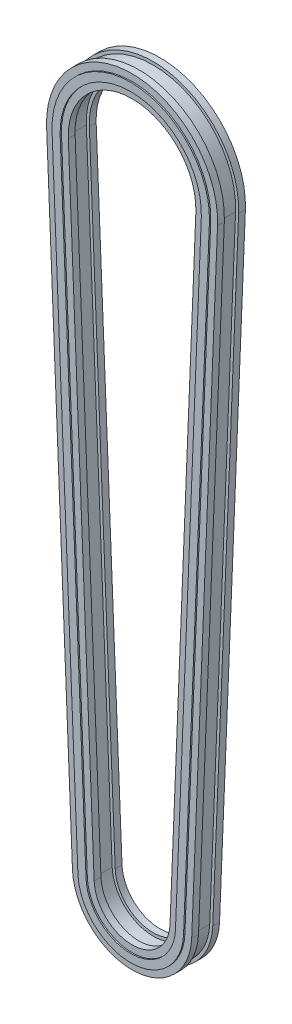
ISO-10303-21;
HEADER;
FILE_DESCRIPTION(('STEP AP214'),'2;1');
FILE_NAME('part.step','',(''),(''),'','','');
FILE_SCHEMA(('AUTOMOTIVE_DESIGN { 1 0 10303 214 1 1 1 1 }'));
ENDSEC;
DATA;
#1=APPLICATION_CONTEXT('core data for automotive mechanical design processes');
#2=APPLICATION_PROTOCOL_DEFINITION('international standard','automotive_design',2000,#1);
#3=PRODUCT_CONTEXT('',#1,'mechanical');
#4=PRODUCT('Part','Part','',(#3));
#5=PRODUCT_RELATED_PRODUCT_CATEGORY('part','',(#4));
#6=PRODUCT_DEFINITION_FORMATION('','',#4);
#7=PRODUCT_DEFINITION_CONTEXT('part definition',#1,'design');
#8=PRODUCT_DEFINITION('design','',#6,#7);
#9=PRODUCT_DEFINITION_SHAPE('','',#8);
#10=(LENGTH_UNIT() NAMED_UNIT(*) SI_UNIT(.MILLI.,.METRE.));
#11=(NAMED_UNIT(*) PLANE_ANGLE_UNIT() SI_UNIT($,.RADIAN.));
#12=(NAMED_UNIT(*) SI_UNIT($,.STERADIAN.) SOLID_ANGLE_UNIT());
#13=UNCERTAINTY_MEASURE_WITH_UNIT(LENGTH_MEASURE(1.E-05),#10,'distance_accuracy_value','');
#14=(GEOMETRIC_REPRESENTATION_CONTEXT(3) GLOBAL_UNCERTAINTY_ASSIGNED_CONTEXT((#13)) GLOBAL_UNIT_ASSIGNED_CONTEXT((#10,
#11,#12)) REPRESENTATION_CONTEXT('',''));
#15=CARTESIAN_POINT('',(0.,0.,0.));
#16=DIRECTION('',(0.,0.,1.));
#17=DIRECTION('',(1.,0.,0.));
#18=AXIS2_PLACEMENT_3D('',#15,#16,#17);
#19=CARTESIAN_POINT('',(20.6126482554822,-0.84595029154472,7.57));
#20=DIRECTION('',(-0.999158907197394,0.0410058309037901,0.));
#21=DIRECTION('',(-0.0410058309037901,-0.999158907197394,0.));
#22=AXIS2_PLACEMENT_3D('',#19,#20,#21);
#23=PLANE('',#22);
#24=DIRECTION('',(0.,0.,1.));
#25=VECTOR('',#24,1.);
#26=CARTESIAN_POINT('',(20.6126482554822,-0.84595029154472,7.57));
#27=LINE('',#26,#25);
#28=CARTESIAN_POINT('',(20.6126482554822,-0.84595029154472,3.875));
#29=VERTEX_POINT('',#28);
#30=CARTESIAN_POINT('',(20.6126482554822,-0.84595029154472,7.57));
#31=VERTEX_POINT('',#30);
#32=EDGE_CURVE('E320',#29,#31,#27,.T.);
#33=ORIENTED_EDGE('',*,*,#32,.T.);
#34=DIRECTION('',(0.0410058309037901,0.999158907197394,0.));
#35=VECTOR('',#34,1.);
#36=CARTESIAN_POINT('',(20.6126482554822,-0.84595029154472,7.57));
#37=LINE('',#36,#35);
#38=CARTESIAN_POINT('',(34.6658182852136,341.577302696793,7.57));
#39=VERTEX_POINT('',#38);
#40=EDGE_CURVE('E48',#31,#39,#37,.T.);
#41=ORIENTED_EDGE('',*,*,#40,.T.);
#42=CARTESIAN_POINT('',(34.6658182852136,341.577302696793,3.875));
#43=DIRECTION('',(0.,0.,1.));
#44=VECTOR('',#43,1.);
#45=LINE('',#42,#44);
#46=CARTESIAN_POINT('',(34.6658182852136,341.577302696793,3.875));
#47=VERTEX_POINT('',#46);
#48=EDGE_CURVE('E310',#47,#39,#45,.T.);
#49=ORIENTED_EDGE('',*,*,#48,.F.);
#50=DIRECTION('',(0.0410058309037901,0.999158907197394,0.));
#51=VECTOR('',#50,1.);
#52=CARTESIAN_POINT('',(20.6126482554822,-0.84595029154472,3.875));
#53=LINE('',#52,#51);
#54=EDGE_CURVE('E11',#29,#47,#53,.T.);
#55=ORIENTED_EDGE('',*,*,#54,.F.);
#56=EDGE_LOOP('',(#33,#41,#49,#55));
#57=FACE_BOUND('',#56,.T.);
#58=ADVANCED_FACE('F36',(#57),#23,.T.);
#59=CARTESIAN_POINT('',(24.3095362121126,-0.997671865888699,8.3));
#60=DIRECTION('',(-0.999158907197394,0.0410058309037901,0.));
#61=DIRECTION('',(-0.0410058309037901,-0.999158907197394,0.));
#62=AXIS2_PLACEMENT_3D('',#59,#60,#61);
#63=PLANE('',#62);
#64=DIRECTION('',(0.,0.,1.));
#65=VECTOR('',#64,1.);
#66=CARTESIAN_POINT('',(24.3095362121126,-0.997671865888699,8.3));
#67=LINE('',#66,#65);
#68=CARTESIAN_POINT('',(24.3095362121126,-0.997671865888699,7.57));
#69=VERTEX_POINT('',#68);
#70=CARTESIAN_POINT('',(24.3095362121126,-0.997671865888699,8.3));
#71=VERTEX_POINT('',#70);
#72=EDGE_CURVE('E733',#69,#71,#67,.T.);
#73=ORIENTED_EDGE('',*,*,#72,.T.);
#74=DIRECTION('',(0.0410058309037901,0.999158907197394,0.));
#75=VECTOR('',#74,1.);
#76=CARTESIAN_POINT('',(24.3095362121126,-0.997671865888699,8.3));
#77=LINE('',#76,#75);
#78=CARTESIAN_POINT('',(38.3627062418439,341.425581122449,8.3));
#79=VERTEX_POINT('',#78);
#80=EDGE_CURVE('E329',#71,#79,#77,.T.);
#81=ORIENTED_EDGE('',*,*,#80,.T.);
#82=CARTESIAN_POINT('',(38.3627062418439,341.425581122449,7.57));
#83=DIRECTION('',(0.,0.,1.));
#84=VECTOR('',#83,1.);
#85=LINE('',#82,#84);
#86=CARTESIAN_POINT('',(38.3627062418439,341.425581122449,7.57));
#87=VERTEX_POINT('',#86);
#88=EDGE_CURVE('E316',#87,#79,#85,.T.);
#89=ORIENTED_EDGE('',*,*,#88,.F.);
#90=DIRECTION('',(0.0410058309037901,0.999158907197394,0.));
#91=VECTOR('',#90,1.);
#92=CARTESIAN_POINT('',(24.3095362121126,-0.997671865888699,7.57));
#93=LINE('',#92,#91);
#94=EDGE_CURVE('E323',#69,#87,#93,.T.);
#95=ORIENTED_EDGE('',*,*,#94,.F.);
#96=EDGE_LOOP('',(#73,#81,#89,#95));
#97=FACE_BOUND('',#96,.T.);
#98=ADVANCED_FACE('F348',(#97),#63,.T.);
#99=CARTESIAN_POINT('',(28.7058354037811,-1.17809752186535,7.57));
#100=DIRECTION('',(0.999158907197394,-0.0410058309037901,0.));
#101=DIRECTION('',(0.0410058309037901,0.999158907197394,0.));
#102=AXIS2_PLACEMENT_3D('',#99,#100,#101);
#103=PLANE('',#102);
#104=DIRECTION('',(0.,0.,-1.));
#105=VECTOR('',#104,1.);
#106=CARTESIAN_POINT('',(28.7058354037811,-1.17809752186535,7.57));
#107=LINE('',#106,#105);
#108=CARTESIAN_POINT('',(28.7058354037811,-1.17809752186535,8.3));
#109=VERTEX_POINT('',#108);
#110=CARTESIAN_POINT('',(28.7058354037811,-1.17809752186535,7.57));
#111=VERTEX_POINT('',#110);
#112=EDGE_CURVE('E729',#109,#111,#107,.T.);
#113=ORIENTED_EDGE('',*,*,#112,.T.);
#114=DIRECTION('',(0.0410058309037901,0.999158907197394,0.));
#115=VECTOR('',#114,1.);
#116=CARTESIAN_POINT('',(28.7058354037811,-1.17809752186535,7.57));
#117=LINE('',#116,#115);
#118=CARTESIAN_POINT('',(42.7590054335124,341.245155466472,7.57));
#119=VERTEX_POINT('',#118);
#120=EDGE_CURVE('E372',#111,#119,#117,.T.);
#121=ORIENTED_EDGE('',*,*,#120,.T.);
#122=CARTESIAN_POINT('',(42.7590054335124,341.245155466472,8.3));
#123=DIRECTION('',(0.,0.,-1.));
#124=VECTOR('',#123,1.);
#125=LINE('',#122,#124);
#126=CARTESIAN_POINT('',(42.7590054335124,341.245155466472,8.3));
#127=VERTEX_POINT('',#126);
#128=EDGE_CURVE('E824',#127,#119,#125,.T.);
#129=ORIENTED_EDGE('',*,*,#128,.F.);
#130=DIRECTION('',(0.0410058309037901,0.999158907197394,0.));
#131=VECTOR('',#130,1.);
#132=CARTESIAN_POINT('',(28.7058354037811,-1.17809752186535,8.3));
#133=LINE('',#132,#131);
#134=EDGE_CURVE('E381',#109,#127,#133,.T.);
#135=ORIENTED_EDGE('',*,*,#134,.F.);
#136=EDGE_LOOP('',(#113,#121,#129,#135));
#137=FACE_BOUND('',#136,.T.);
#138=ADVANCED_FACE('F357',(#137),#103,.T.);
#139=CARTESIAN_POINT('',(32.4027233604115,-1.32981909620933,3.875));
#140=DIRECTION('',(0.999158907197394,-0.0410058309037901,0.));
#141=DIRECTION('',(0.0410058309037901,0.999158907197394,0.));
#142=AXIS2_PLACEMENT_3D('',#139,#140,#141);
#143=PLANE('',#142);
#144=DIRECTION('',(0.,0.,-1.));
#145=VECTOR('',#144,1.);
#146=CARTESIAN_POINT('',(32.4027233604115,-1.32981909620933,3.875));
#147=LINE('',#146,#145);
#148=CARTESIAN_POINT('',(32.4027233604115,-1.32981909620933,7.57));
#149=VERTEX_POINT('',#148);
#150=CARTESIAN_POINT('',(32.4027233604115,-1.32981909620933,3.875));
#151=VERTEX_POINT('',#150);
#152=EDGE_CURVE('E725',#149,#151,#147,.T.);
#153=ORIENTED_EDGE('',*,*,#152,.T.);
#154=DIRECTION('',(0.0410058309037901,0.999158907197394,0.));
#155=VECTOR('',#154,1.);
#156=CARTESIAN_POINT('',(32.4027233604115,-1.32981909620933,3.875));
#157=LINE('',#156,#155);
#158=CARTESIAN_POINT('',(46.4558933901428,341.093433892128,3.875));
#159=VERTEX_POINT('',#158);
#160=EDGE_CURVE('E388',#151,#159,#157,.T.);
#161=ORIENTED_EDGE('',*,*,#160,.T.);
#162=CARTESIAN_POINT('',(46.4558933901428,341.093433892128,7.57));
#163=DIRECTION('',(0.,0.,-1.));
#164=VECTOR('',#163,1.);
#165=LINE('',#162,#164);
#166=CARTESIAN_POINT('',(46.4558933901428,341.093433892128,7.57));
#167=VERTEX_POINT('',#166);
#168=EDGE_CURVE('E396',#167,#159,#165,.T.);
#169=ORIENTED_EDGE('',*,*,#168,.F.);
#170=DIRECTION('',(0.0410058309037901,0.999158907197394,0.));
#171=VECTOR('',#170,1.);
#172=CARTESIAN_POINT('',(32.4027233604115,-1.32981909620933,7.57));
#173=LINE('',#172,#171);
#174=EDGE_CURVE('E382',#149,#167,#173,.T.);
#175=ORIENTED_EDGE('',*,*,#174,.F.);
#176=EDGE_LOOP('',(#153,#161,#169,#175));
#177=FACE_BOUND('',#176,.T.);
#178=ADVANCED_FACE('F361',(#177),#143,.T.);
#179=CARTESIAN_POINT('',(30.7541111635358,-1.26215947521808,-3.875));
#180=DIRECTION('',(0.999158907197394,-0.0410058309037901,0.));
#181=DIRECTION('',(0.0410058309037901,0.999158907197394,0.));
#182=AXIS2_PLACEMENT_3D('',#179,#180,#181);
#183=PLANE('',#182);
#184=DIRECTION('',(0.,0.,-1.));
#185=VECTOR('',#184,1.);
#186=CARTESIAN_POINT('',(30.7541111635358,-1.26215947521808,-3.875));
#187=LINE('',#186,#185);
#188=CARTESIAN_POINT('',(30.7541111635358,-1.26215947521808,3.875));
#189=VERTEX_POINT('',#188);
#190=CARTESIAN_POINT('',(30.7541111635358,-1.26215947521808,-3.875));
#191=VERTEX_POINT('',#190);
#192=EDGE_CURVE('E721',#189,#191,#187,.T.);
#193=ORIENTED_EDGE('',*,*,#192,.T.);
#194=DIRECTION('',(0.0410058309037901,0.999158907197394,0.));
#195=VECTOR('',#194,1.);
#196=CARTESIAN_POINT('',(30.7541111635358,-1.26215947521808,-3.875));
#197=LINE('',#196,#195);
#198=CARTESIAN_POINT('',(44.8072811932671,341.16109351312,-3.875));
#199=VERTEX_POINT('',#198);
#200=EDGE_CURVE('E413',#191,#199,#197,.T.);
#201=ORIENTED_EDGE('',*,*,#200,.T.);
#202=CARTESIAN_POINT('',(44.8072811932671,341.16109351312,3.875));
#203=DIRECTION('',(0.,0.,-1.));
#204=VECTOR('',#203,1.);
#205=LINE('',#202,#204);
#206=CARTESIAN_POINT('',(44.8072811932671,341.16109351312,3.875));
#207=VERTEX_POINT('',#206);
#208=EDGE_CURVE('E421',#207,#199,#205,.T.);
#209=ORIENTED_EDGE('',*,*,#208,.F.);
#210=DIRECTION('',(0.0410058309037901,0.999158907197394,0.));
#211=VECTOR('',#210,1.);
#212=CARTESIAN_POINT('',(30.7541111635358,-1.26215947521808,3.875));
#213=LINE('',#212,#211);
#214=EDGE_CURVE('E407',#189,#207,#213,.T.);
#215=ORIENTED_EDGE('',*,*,#214,.F.);
#216=EDGE_LOOP('',(#193,#201,#209,#215));
#217=FACE_BOUND('',#216,.T.);
#218=ADVANCED_FACE('F426',(#217),#183,.T.);
#219=CARTESIAN_POINT('',(32.4027233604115,-1.32981909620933,-7.57));
#220=DIRECTION('',(0.999158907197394,-0.0410058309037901,0.));
#221=DIRECTION('',(0.0410058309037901,0.999158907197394,0.));
#222=AXIS2_PLACEMENT_3D('',#219,#220,#221);
#223=PLANE('',#222);
#224=DIRECTION('',(0.,0.,-1.));
#225=VECTOR('',#224,1.);
#226=CARTESIAN_POINT('',(32.4027233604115,-1.32981909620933,-7.57));
#227=LINE('',#226,#225);
#228=CARTESIAN_POINT('',(32.4027233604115,-1.32981909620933,-3.875));
#229=VERTEX_POINT('',#228);
#230=CARTESIAN_POINT('',(32.4027233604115,-1.32981909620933,-7.57));
#231=VERTEX_POINT('',#230);
#232=EDGE_CURVE('E717',#229,#231,#227,.T.);
#233=ORIENTED_EDGE('',*,*,#232,.T.);
#234=DIRECTION('',(0.0410058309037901,0.999158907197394,0.));
#235=VECTOR('',#234,1.);
#236=CARTESIAN_POINT('',(32.4027233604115,-1.32981909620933,-7.57));
#237=LINE('',#236,#235);
#238=CARTESIAN_POINT('',(46.4558933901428,341.093433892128,-7.57));
#239=VERTEX_POINT('',#238);
#240=EDGE_CURVE('E450',#231,#239,#237,.T.);
#241=ORIENTED_EDGE('',*,*,#240,.T.);
#242=CARTESIAN_POINT('',(46.4558933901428,341.093433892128,-3.875));
#243=DIRECTION('',(0.,0.,-1.));
#244=VECTOR('',#243,1.);
#245=LINE('',#242,#244);
#246=CARTESIAN_POINT('',(46.4558933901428,341.093433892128,-3.875));
#247=VERTEX_POINT('',#246);
#248=EDGE_CURVE('E1080',#247,#239,#245,.T.);
#249=ORIENTED_EDGE('',*,*,#248,.F.);
#250=DIRECTION('',(0.0410058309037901,0.999158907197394,0.));
#251=VECTOR('',#250,1.);
#252=CARTESIAN_POINT('',(32.4027233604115,-1.32981909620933,-3.875));
#253=LINE('',#252,#251);
#254=EDGE_CURVE('E459',#229,#247,#253,.T.);
#255=ORIENTED_EDGE('',*,*,#254,.F.);
#256=EDGE_LOOP('',(#233,#241,#249,#255));
#257=FACE_BOUND('',#256,.T.);
#258=ADVANCED_FACE('F435',(#257),#223,.T.);
#259=CARTESIAN_POINT('',(28.7058354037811,-1.17809752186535,-8.3));
#260=DIRECTION('',(0.999158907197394,-0.0410058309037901,0.));
#261=DIRECTION('',(0.0410058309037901,0.999158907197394,0.));
#262=AXIS2_PLACEMENT_3D('',#259,#260,#261);
#263=PLANE('',#262);
#264=DIRECTION('',(0.,0.,-1.));
#265=VECTOR('',#264,1.);
#266=CARTESIAN_POINT('',(28.7058354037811,-1.17809752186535,-8.3));
#267=LINE('',#266,#265);
#268=CARTESIAN_POINT('',(28.7058354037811,-1.17809752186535,-7.57));
#269=VERTEX_POINT('',#268);
#270=CARTESIAN_POINT('',(28.7058354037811,-1.17809752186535,-8.3));
#271=VERTEX_POINT('',#270);
#272=EDGE_CURVE('E713',#269,#271,#267,.T.);
#273=ORIENTED_EDGE('',*,*,#272,.T.);
#274=DIRECTION('',(0.0410058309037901,0.999158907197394,0.));
#275=VECTOR('',#274,1.);
#276=CARTESIAN_POINT('',(28.7058354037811,-1.17809752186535,-8.3));
#277=LINE('',#276,#275);
#278=CARTESIAN_POINT('',(42.7590054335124,341.245155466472,-8.3));
#279=VERTEX_POINT('',#278);
#280=EDGE_CURVE('E466',#271,#279,#277,.T.);
#281=ORIENTED_EDGE('',*,*,#280,.T.);
#282=CARTESIAN_POINT('',(42.7590054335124,341.245155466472,-7.57));
#283=DIRECTION('',(0.,0.,-1.));
#284=VECTOR('',#283,1.);
#285=LINE('',#282,#284);
#286=CARTESIAN_POINT('',(42.7590054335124,341.245155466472,-7.57));
#287=VERTEX_POINT('',#286);
#288=EDGE_CURVE('E474',#287,#279,#285,.T.);
#289=ORIENTED_EDGE('',*,*,#288,.F.);
#290=DIRECTION('',(0.0410058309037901,0.999158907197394,0.));
#291=VECTOR('',#290,1.);
#292=CARTESIAN_POINT('',(28.7058354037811,-1.17809752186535,-7.57));
#293=LINE('',#292,#291);
#294=EDGE_CURVE('E460',#269,#287,#293,.T.);
#295=ORIENTED_EDGE('',*,*,#294,.F.);
#296=EDGE_LOOP('',(#273,#281,#289,#295));
#297=FACE_BOUND('',#296,.T.);
#298=ADVANCED_FACE('F439',(#297),#263,.T.);
#299=CARTESIAN_POINT('',(24.3095362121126,-0.997671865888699,-7.57));
#300=DIRECTION('',(-0.999158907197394,0.0410058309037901,0.));
#301=DIRECTION('',(-0.0410058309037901,-0.999158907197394,0.));
#302=AXIS2_PLACEMENT_3D('',#299,#300,#301);
#303=PLANE('',#302);
#304=DIRECTION('',(0.,0.,1.));
#305=VECTOR('',#304,1.);
#306=CARTESIAN_POINT('',(24.3095362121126,-0.997671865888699,-7.57));
#307=LINE('',#306,#305);
#308=CARTESIAN_POINT('',(24.3095362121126,-0.997671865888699,-8.3));
#309=VERTEX_POINT('',#308);
#310=CARTESIAN_POINT('',(24.3095362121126,-0.997671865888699,-7.57));
#311=VERTEX_POINT('',#310);
#312=EDGE_CURVE('E709',#309,#311,#307,.T.);
#313=ORIENTED_EDGE('',*,*,#312,.T.);
#314=DIRECTION('',(0.0410058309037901,0.999158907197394,0.));
#315=VECTOR('',#314,1.);
#316=CARTESIAN_POINT('',(24.3095362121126,-0.997671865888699,-7.57));
#317=LINE('',#316,#315);
#318=CARTESIAN_POINT('',(38.3627062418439,341.425581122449,-7.57));
#319=VERTEX_POINT('',#318);
#320=EDGE_CURVE('E491',#311,#319,#317,.T.);
#321=ORIENTED_EDGE('',*,*,#320,.T.);
#322=CARTESIAN_POINT('',(38.3627062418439,341.425581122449,-8.3));
#323=DIRECTION('',(0.,0.,1.));
#324=VECTOR('',#323,1.);
#325=LINE('',#322,#324);
#326=CARTESIAN_POINT('',(38.3627062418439,341.425581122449,-8.3));
#327=VERTEX_POINT('',#326);
#328=EDGE_CURVE('E499',#327,#319,#325,.T.);
#329=ORIENTED_EDGE('',*,*,#328,.F.);
#330=DIRECTION('',(0.0410058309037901,0.999158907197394,0.));
#331=VECTOR('',#330,1.);
#332=CARTESIAN_POINT('',(24.3095362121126,-0.997671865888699,-8.3));
#333=LINE('',#332,#331);
#334=EDGE_CURVE('E485',#309,#327,#333,.T.);
#335=ORIENTED_EDGE('',*,*,#334,.F.);
#336=EDGE_LOOP('',(#313,#321,#329,#335));
#337=FACE_BOUND('',#336,.T.);
#338=ADVANCED_FACE('F504',(#337),#303,.T.);
#339=CARTESIAN_POINT('',(20.6126482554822,-0.84595029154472,-3.875));
#340=DIRECTION('',(-0.999158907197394,0.0410058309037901,0.));
#341=DIRECTION('',(-0.0410058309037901,-0.999158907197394,0.));
#342=AXIS2_PLACEMENT_3D('',#339,#340,#341);
#343=PLANE('',#342);
#344=DIRECTION('',(0.,0.,1.));
#345=VECTOR('',#344,1.);
#346=CARTESIAN_POINT('',(20.6126482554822,-0.84595029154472,-3.875));
#347=LINE('',#346,#345);
#348=CARTESIAN_POINT('',(20.6126482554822,-0.84595029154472,-7.57));
#349=VERTEX_POINT('',#348);
#350=CARTESIAN_POINT('',(20.6126482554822,-0.84595029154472,-3.875));
#351=VERTEX_POINT('',#350);
#352=EDGE_CURVE('E705',#349,#351,#347,.T.);
#353=ORIENTED_EDGE('',*,*,#352,.T.);
#354=DIRECTION('',(0.0410058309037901,0.999158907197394,0.));
#355=VECTOR('',#354,1.);
#356=CARTESIAN_POINT('',(20.6126482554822,-0.84595029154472,-3.875));
#357=LINE('',#356,#355);
#358=CARTESIAN_POINT('',(34.6658182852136,341.577302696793,-3.875));
#359=VERTEX_POINT('',#358);
#360=EDGE_CURVE('E528',#351,#359,#357,.T.);
#361=ORIENTED_EDGE('',*,*,#360,.T.);
#362=CARTESIAN_POINT('',(34.6658182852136,341.577302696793,-7.57));
#363=DIRECTION('',(0.,0.,1.));
#364=VECTOR('',#363,1.);
#365=LINE('',#362,#364);
#366=CARTESIAN_POINT('',(34.6658182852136,341.577302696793,-7.57));
#367=VERTEX_POINT('',#366);
#368=EDGE_CURVE('E978',#367,#359,#365,.T.);
#369=ORIENTED_EDGE('',*,*,#368,.F.);
#370=DIRECTION('',(0.0410058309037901,0.999158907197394,0.));
#371=VECTOR('',#370,1.);
#372=CARTESIAN_POINT('',(20.6126482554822,-0.84595029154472,-7.57));
#373=LINE('',#372,#371);
#374=EDGE_CURVE('E537',#349,#367,#373,.T.);
#375=ORIENTED_EDGE('',*,*,#374,.F.);
#376=EDGE_LOOP('',(#353,#361,#369,#375));
#377=FACE_BOUND('',#376,.T.);
#378=ADVANCED_FACE('F513',(#377),#343,.T.);
#379=CARTESIAN_POINT('',(22.2612604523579,-0.913609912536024,3.875));
#380=DIRECTION('',(-0.999158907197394,0.0410058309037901,0.));
#381=DIRECTION('',(-0.0410058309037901,-0.999158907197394,0.));
#382=AXIS2_PLACEMENT_3D('',#379,#380,#381);
#383=PLANE('',#382);
#384=DIRECTION('',(0.,0.,1.));
#385=VECTOR('',#384,1.);
#386=CARTESIAN_POINT('',(22.2612604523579,-0.913609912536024,3.875));
#387=LINE('',#386,#385);
#388=CARTESIAN_POINT('',(22.2612604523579,-0.913609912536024,-3.875));
#389=VERTEX_POINT('',#388);
#390=CARTESIAN_POINT('',(22.2612604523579,-0.913609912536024,3.875));
#391=VERTEX_POINT('',#390);
#392=EDGE_CURVE('E702',#389,#391,#387,.T.);
#393=ORIENTED_EDGE('',*,*,#392,.T.);
#394=DIRECTION('',(0.0410058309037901,0.999158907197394,0.));
#395=VECTOR('',#394,1.);
#396=CARTESIAN_POINT('',(22.2612604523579,-0.913609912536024,3.875));
#397=LINE('',#396,#395);
#398=CARTESIAN_POINT('',(36.3144304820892,341.509643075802,3.875));
#399=VERTEX_POINT('',#398);
#400=EDGE_CURVE('E64',#391,#399,#397,.T.);
#401=ORIENTED_EDGE('',*,*,#400,.T.);
#402=CARTESIAN_POINT('',(36.3144304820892,341.509643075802,-3.875));
#403=DIRECTION('',(0.,0.,1.));
#404=VECTOR('',#403,1.);
#405=LINE('',#402,#404);
#406=CARTESIAN_POINT('',(36.3144304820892,341.509643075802,-3.875));
#407=VERTEX_POINT('',#406);
#408=EDGE_CURVE('E548',#407,#399,#405,.T.);
#409=ORIENTED_EDGE('',*,*,#408,.F.);
#410=DIRECTION('',(0.0410058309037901,0.999158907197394,0.));
#411=VECTOR('',#410,1.);
#412=CARTESIAN_POINT('',(22.2612604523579,-0.913609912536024,-3.875));
#413=LINE('',#412,#411);
#414=EDGE_CURVE('E538',#389,#407,#413,.T.);
#415=ORIENTED_EDGE('',*,*,#414,.F.);
#416=EDGE_LOOP('',(#393,#401,#409,#415));
#417=FACE_BOUND('',#416,.T.);
#418=ADVANCED_FACE('F517',(#417),#383,.T.);
#419=CARTESIAN_POINT('',(0.,0.,0.));
#420=DIRECTION('',(0.,0.,1.));
#421=DIRECTION('',(1.,0.,0.));
#422=AXIS2_PLACEMENT_3D('',#419,#420,#421);
#423=CYLINDRICAL_SURFACE('',#422,20.63);
#424=DIRECTION('',(0.,0.,1.));
#425=VECTOR('',#424,1.);
#426=CARTESIAN_POINT('',(-20.6126482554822,-0.845950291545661,7.57));
#427=LINE('',#426,#425);
#428=CARTESIAN_POINT('',(-20.6126482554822,-0.845950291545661,3.875));
#429=VERTEX_POINT('',#428);
#430=CARTESIAN_POINT('',(-20.6126482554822,-0.845950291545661,7.57));
#431=VERTEX_POINT('',#430);
#432=EDGE_CURVE('E622',#429,#431,#427,.T.);
#433=ORIENTED_EDGE('',*,*,#432,.T.);
#434=CARTESIAN_POINT('',(0.,0.,7.57));
#435=DIRECTION('',(0.,0.,1.));
#436=DIRECTION('',(1.,0.,0.));
#437=AXIS2_PLACEMENT_3D('',#434,#435,#436);
#438=CIRCLE('',#437,20.63);
#439=EDGE_CURVE('E810',#431,#31,#438,.T.);
#440=ORIENTED_EDGE('',*,*,#439,.T.);
#441=ORIENTED_EDGE('',*,*,#32,.F.);
#442=CARTESIAN_POINT('',(0.,0.,3.875));
#443=DIRECTION('',(0.,0.,1.));
#444=DIRECTION('',(1.,0.,0.));
#445=AXIS2_PLACEMENT_3D('',#442,#443,#444);
#446=CIRCLE('',#445,20.63);
#447=EDGE_CURVE('E813',#429,#29,#446,.T.);
#448=ORIENTED_EDGE('',*,*,#447,.F.);
#449=EDGE_LOOP('',(#433,#440,#441,#448));
#450=FACE_BOUND('',#449,.T.);
#451=ADVANCED_FACE('F1161',(#450),#423,.F.);
#452=CARTESIAN_POINT('',(0.,0.,0.));
#453=DIRECTION('',(0.,0.,1.));
#454=DIRECTION('',(1.,0.,0.));
#455=AXIS2_PLACEMENT_3D('',#452,#453,#454);
#456=CYLINDRICAL_SURFACE('',#455,24.33);
#457=DIRECTION('',(0.,0.,1.));
#458=VECTOR('',#457,1.);
#459=CARTESIAN_POINT('',(-24.3095362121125,-0.997671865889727,8.3));
#460=LINE('',#459,#458);
#461=CARTESIAN_POINT('',(-24.3095362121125,-0.997671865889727,7.57));
#462=VERTEX_POINT('',#461);
#463=CARTESIAN_POINT('',(-24.3095362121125,-0.997671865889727,8.3));
#464=VERTEX_POINT('',#463);
#465=EDGE_CURVE('E618',#462,#464,#460,.T.);
#466=ORIENTED_EDGE('',*,*,#465,.T.);
#467=CARTESIAN_POINT('',(0.,0.,8.3));
#468=DIRECTION('',(0.,0.,1.));
#469=DIRECTION('',(1.,0.,0.));
#470=AXIS2_PLACEMENT_3D('',#467,#468,#469);
#471=CIRCLE('',#470,24.33);
#472=EDGE_CURVE('E802',#464,#71,#471,.T.);
#473=ORIENTED_EDGE('',*,*,#472,.T.);
#474=ORIENTED_EDGE('',*,*,#72,.F.);
#475=CARTESIAN_POINT('',(0.,0.,7.57));
#476=DIRECTION('',(0.,0.,1.));
#477=DIRECTION('',(1.,0.,0.));
#478=AXIS2_PLACEMENT_3D('',#475,#476,#477);
#479=CIRCLE('',#478,24.33);
#480=EDGE_CURVE('E806',#462,#69,#479,.T.);
#481=ORIENTED_EDGE('',*,*,#480,.F.);
#482=EDGE_LOOP('',(#466,#473,#474,#481));
#483=FACE_BOUND('',#482,.T.);
#484=ADVANCED_FACE('F1166',(#483),#456,.F.);
#485=CARTESIAN_POINT('',(0.,0.,0.));
#486=DIRECTION('',(0.,0.,1.));
#487=DIRECTION('',(1.,0.,0.));
#488=AXIS2_PLACEMENT_3D('',#485,#486,#487);
#489=CYLINDRICAL_SURFACE('',#488,28.73);
#490=DIRECTION('',(0.,0.,-1.));
#491=VECTOR('',#490,1.);
#492=CARTESIAN_POINT('',(-28.7058354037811,-1.17809752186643,7.57));
#493=LINE('',#492,#491);
#494=CARTESIAN_POINT('',(-28.7058354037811,-1.17809752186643,8.3));
#495=VERTEX_POINT('',#494);
#496=CARTESIAN_POINT('',(-28.7058354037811,-1.17809752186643,7.57));
#497=VERTEX_POINT('',#496);
#498=EDGE_CURVE('E614',#495,#497,#493,.T.);
#499=ORIENTED_EDGE('',*,*,#498,.T.);
#500=CARTESIAN_POINT('',(0.,0.,7.57));
#501=DIRECTION('',(0.,0.,1.));
#502=DIRECTION('',(1.,0.,0.));
#503=AXIS2_PLACEMENT_3D('',#500,#501,#502);
#504=CIRCLE('',#503,28.73);
#505=EDGE_CURVE('E794',#497,#111,#504,.T.);
#506=ORIENTED_EDGE('',*,*,#505,.T.);
#507=ORIENTED_EDGE('',*,*,#112,.F.);
#508=CARTESIAN_POINT('',(0.,0.,8.3));
#509=DIRECTION('',(0.,0.,1.));
#510=DIRECTION('',(1.,0.,0.));
#511=AXIS2_PLACEMENT_3D('',#508,#509,#510);
#512=CIRCLE('',#511,28.73);
#513=EDGE_CURVE('E798',#495,#109,#512,.T.);
#514=ORIENTED_EDGE('',*,*,#513,.F.);
#515=EDGE_LOOP('',(#499,#506,#507,#514));
#516=FACE_BOUND('',#515,.T.);
#517=ADVANCED_FACE('F858',(#516),#489,.T.);
#518=CARTESIAN_POINT('',(0.,0.,0.));
#519=DIRECTION('',(0.,0.,1.));
#520=DIRECTION('',(1.,0.,0.));
#521=AXIS2_PLACEMENT_3D('',#518,#519,#520);
#522=CYLINDRICAL_SURFACE('',#521,32.43);
#523=DIRECTION('',(0.,0.,-1.));
#524=VECTOR('',#523,1.);
#525=CARTESIAN_POINT('',(-32.4027233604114,-1.32981909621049,3.875));
#526=LINE('',#525,#524);
#527=CARTESIAN_POINT('',(-32.4027233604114,-1.32981909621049,7.57));
#528=VERTEX_POINT('',#527);
#529=CARTESIAN_POINT('',(-32.4027233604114,-1.32981909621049,3.875));
#530=VERTEX_POINT('',#529);
#531=EDGE_CURVE('E610',#528,#530,#526,.T.);
#532=ORIENTED_EDGE('',*,*,#531,.T.);
#533=CARTESIAN_POINT('',(0.,0.,3.875));
#534=DIRECTION('',(0.,0.,1.));
#535=DIRECTION('',(1.,0.,0.));
#536=AXIS2_PLACEMENT_3D('',#533,#534,#535);
#537=CIRCLE('',#536,32.43);
#538=EDGE_CURVE('E786',#530,#151,#537,.T.);
#539=ORIENTED_EDGE('',*,*,#538,.T.);
#540=ORIENTED_EDGE('',*,*,#152,.F.);
#541=CARTESIAN_POINT('',(0.,0.,7.57));
#542=DIRECTION('',(0.,0.,1.));
#543=DIRECTION('',(1.,0.,0.));
#544=AXIS2_PLACEMENT_3D('',#541,#542,#543);
#545=CIRCLE('',#544,32.43);
#546=EDGE_CURVE('E790',#528,#149,#545,.T.);
#547=ORIENTED_EDGE('',*,*,#546,.F.);
#548=EDGE_LOOP('',(#532,#539,#540,#547));
#549=FACE_BOUND('',#548,.T.);
#550=ADVANCED_FACE('F1178',(#549),#522,.T.);
#551=CARTESIAN_POINT('',(0.,0.,0.));
#552=DIRECTION('',(0.,0.,1.));
#553=DIRECTION('',(1.,0.,0.));
#554=AXIS2_PLACEMENT_3D('',#551,#552,#553);
#555=CYLINDRICAL_SURFACE('',#554,30.78);
#556=DIRECTION('',(0.,0.,-1.));
#557=VECTOR('',#556,1.);
#558=CARTESIAN_POINT('',(-30.7541111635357,-1.26215947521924,-3.875));
#559=LINE('',#558,#557);
#560=CARTESIAN_POINT('',(-30.7541111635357,-1.26215947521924,3.875));
#561=VERTEX_POINT('',#560);
#562=CARTESIAN_POINT('',(-30.7541111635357,-1.26215947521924,-3.875));
#563=VERTEX_POINT('',#562);
#564=EDGE_CURVE('E606',#561,#563,#559,.T.);
#565=ORIENTED_EDGE('',*,*,#564,.T.);
#566=CARTESIAN_POINT('',(0.,0.,-3.875));
#567=DIRECTION('',(0.,0.,1.));
#568=DIRECTION('',(1.,0.,0.));
#569=AXIS2_PLACEMENT_3D('',#566,#567,#568);
#570=CIRCLE('',#569,30.78);
#571=EDGE_CURVE('E778',#563,#191,#570,.T.);
#572=ORIENTED_EDGE('',*,*,#571,.T.);
#573=ORIENTED_EDGE('',*,*,#192,.F.);
#574=CARTESIAN_POINT('',(0.,0.,3.875));
#575=DIRECTION('',(0.,0.,1.));
#576=DIRECTION('',(1.,0.,0.));
#577=AXIS2_PLACEMENT_3D('',#574,#575,#576);
#578=CIRCLE('',#577,30.78);
#579=EDGE_CURVE('E782',#561,#189,#578,.T.);
#580=ORIENTED_EDGE('',*,*,#579,.F.);
#581=EDGE_LOOP('',(#565,#572,#573,#580));
#582=FACE_BOUND('',#581,.T.);
#583=ADVANCED_FACE('F1184',(#582),#555,.T.);
#584=CARTESIAN_POINT('',(0.,0.,0.));
#585=DIRECTION('',(0.,0.,1.));
#586=DIRECTION('',(1.,0.,0.));
#587=AXIS2_PLACEMENT_3D('',#584,#585,#586);
#588=CYLINDRICAL_SURFACE('',#587,32.43);
#589=DIRECTION('',(0.,0.,-1.));
#590=VECTOR('',#589,1.);
#591=CARTESIAN_POINT('',(-32.4027233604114,-1.32981909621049,-7.57));
#592=LINE('',#591,#590);
#593=CARTESIAN_POINT('',(-32.4027233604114,-1.32981909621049,-3.875));
#594=VERTEX_POINT('',#593);
#595=CARTESIAN_POINT('',(-32.4027233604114,-1.32981909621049,-7.57));
#596=VERTEX_POINT('',#595);
#597=EDGE_CURVE('E602',#594,#596,#592,.T.);
#598=ORIENTED_EDGE('',*,*,#597,.T.);
#599=CARTESIAN_POINT('',(0.,0.,-7.57));
#600=DIRECTION('',(0.,0.,1.));
#601=DIRECTION('',(1.,0.,0.));
#602=AXIS2_PLACEMENT_3D('',#599,#600,#601);
#603=CIRCLE('',#602,32.43);
#604=EDGE_CURVE('E770',#596,#231,#603,.T.);
#605=ORIENTED_EDGE('',*,*,#604,.T.);
#606=ORIENTED_EDGE('',*,*,#232,.F.);
#607=CARTESIAN_POINT('',(0.,0.,-3.875));
#608=DIRECTION('',(0.,0.,1.));
#609=DIRECTION('',(1.,0.,0.));
#610=AXIS2_PLACEMENT_3D('',#607,#608,#609);
#611=CIRCLE('',#610,32.43);
#612=EDGE_CURVE('E774',#594,#229,#611,.T.);
#613=ORIENTED_EDGE('',*,*,#612,.F.);
#614=EDGE_LOOP('',(#598,#605,#606,#613));
#615=FACE_BOUND('',#614,.T.);
#616=ADVANCED_FACE('F1191',(#615),#588,.T.);
#617=CARTESIAN_POINT('',(0.,0.,0.));
#618=DIRECTION('',(0.,0.,1.));
#619=DIRECTION('',(1.,0.,0.));
#620=AXIS2_PLACEMENT_3D('',#617,#618,#619);
#621=CYLINDRICAL_SURFACE('',#620,28.73);
#622=DIRECTION('',(0.,0.,-1.));
#623=VECTOR('',#622,1.);
#624=CARTESIAN_POINT('',(-28.7058354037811,-1.17809752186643,-8.3));
#625=LINE('',#624,#623);
#626=CARTESIAN_POINT('',(-28.7058354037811,-1.17809752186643,-7.57));
#627=VERTEX_POINT('',#626);
#628=CARTESIAN_POINT('',(-28.7058354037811,-1.17809752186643,-8.3));
#629=VERTEX_POINT('',#628);
#630=EDGE_CURVE('E598',#627,#629,#625,.T.);
#631=ORIENTED_EDGE('',*,*,#630,.T.);
#632=CARTESIAN_POINT('',(0.,0.,-8.3));
#633=DIRECTION('',(0.,0.,1.));
#634=DIRECTION('',(1.,0.,0.));
#635=AXIS2_PLACEMENT_3D('',#632,#633,#634);
#636=CIRCLE('',#635,28.73);
#637=EDGE_CURVE('E762',#629,#271,#636,.T.);
#638=ORIENTED_EDGE('',*,*,#637,.T.);
#639=ORIENTED_EDGE('',*,*,#272,.F.);
#640=CARTESIAN_POINT('',(0.,0.,-7.57));
#641=DIRECTION('',(0.,0.,1.));
#642=DIRECTION('',(1.,0.,0.));
#643=AXIS2_PLACEMENT_3D('',#640,#641,#642);
#644=CIRCLE('',#643,28.73);
#645=EDGE_CURVE('E766',#627,#269,#644,.T.);
#646=ORIENTED_EDGE('',*,*,#645,.F.);
#647=EDGE_LOOP('',(#631,#638,#639,#646));
#648=FACE_BOUND('',#647,.T.);
#649=ADVANCED_FACE('F1198',(#648),#621,.T.);
#650=CARTESIAN_POINT('',(0.,0.,0.));
#651=DIRECTION('',(0.,0.,1.));
#652=DIRECTION('',(1.,0.,0.));
#653=AXIS2_PLACEMENT_3D('',#650,#651,#652);
#654=CYLINDRICAL_SURFACE('',#653,24.33);
#655=DIRECTION('',(0.,0.,1.));
#656=VECTOR('',#655,1.);
#657=CARTESIAN_POINT('',(-24.3095362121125,-0.997671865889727,-7.57));
#658=LINE('',#657,#656);
#659=CARTESIAN_POINT('',(-24.3095362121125,-0.997671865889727,-8.3));
#660=VERTEX_POINT('',#659);
#661=CARTESIAN_POINT('',(-24.3095362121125,-0.997671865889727,-7.57));
#662=VERTEX_POINT('',#661);
#663=EDGE_CURVE('E594',#660,#662,#658,.T.);
#664=ORIENTED_EDGE('',*,*,#663,.T.);
#665=CARTESIAN_POINT('',(0.,0.,-7.57));
#666=DIRECTION('',(0.,0.,1.));
#667=DIRECTION('',(1.,0.,0.));
#668=AXIS2_PLACEMENT_3D('',#665,#666,#667);
#669=CIRCLE('',#668,24.33);
#670=EDGE_CURVE('E754',#662,#311,#669,.T.);
#671=ORIENTED_EDGE('',*,*,#670,.T.);
#672=ORIENTED_EDGE('',*,*,#312,.F.);
#673=CARTESIAN_POINT('',(0.,0.,-8.3));
#674=DIRECTION('',(0.,0.,1.));
#675=DIRECTION('',(1.,0.,0.));
#676=AXIS2_PLACEMENT_3D('',#673,#674,#675);
#677=CIRCLE('',#676,24.33);
#678=EDGE_CURVE('E758',#660,#309,#677,.T.);
#679=ORIENTED_EDGE('',*,*,#678,.F.);
#680=EDGE_LOOP('',(#664,#671,#672,#679));
#681=FACE_BOUND('',#680,.T.);
#682=ADVANCED_FACE('F1205',(#681),#654,.F.);
#683=CARTESIAN_POINT('',(0.,0.,0.));
#684=DIRECTION('',(0.,0.,1.));
#685=DIRECTION('',(1.,0.,0.));
#686=AXIS2_PLACEMENT_3D('',#683,#684,#685);
#687=CYLINDRICAL_SURFACE('',#686,20.63);
#688=DIRECTION('',(0.,0.,1.));
#689=VECTOR('',#688,1.);
#690=CARTESIAN_POINT('',(-20.6126482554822,-0.845950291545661,-3.875));
#691=LINE('',#690,#689);
#692=CARTESIAN_POINT('',(-20.6126482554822,-0.845950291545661,-7.57));
#693=VERTEX_POINT('',#692);
#694=CARTESIAN_POINT('',(-20.6126482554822,-0.845950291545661,-3.875));
#695=VERTEX_POINT('',#694);
#696=EDGE_CURVE('E590',#693,#695,#691,.T.);
#697=ORIENTED_EDGE('',*,*,#696,.T.);
#698=CARTESIAN_POINT('',(0.,0.,-3.875));
#699=DIRECTION('',(0.,0.,1.));
#700=DIRECTION('',(1.,0.,0.));
#701=AXIS2_PLACEMENT_3D('',#698,#699,#700);
#702=CIRCLE('',#701,20.63);
#703=EDGE_CURVE('E747',#695,#351,#702,.T.);
#704=ORIENTED_EDGE('',*,*,#703,.T.);
#705=ORIENTED_EDGE('',*,*,#352,.F.);
#706=CARTESIAN_POINT('',(0.,0.,-7.57));
#707=DIRECTION('',(0.,0.,1.));
#708=DIRECTION('',(1.,0.,0.));
#709=AXIS2_PLACEMENT_3D('',#706,#707,#708);
#710=CIRCLE('',#709,20.63);
#711=EDGE_CURVE('E751',#693,#349,#710,.T.);
#712=ORIENTED_EDGE('',*,*,#711,.F.);
#713=EDGE_LOOP('',(#697,#704,#705,#712));
#714=FACE_BOUND('',#713,.T.);
#715=ADVANCED_FACE('F1212',(#714),#687,.F.);
#716=CARTESIAN_POINT('',(0.,0.,0.));
#717=DIRECTION('',(0.,0.,1.));
#718=DIRECTION('',(1.,0.,0.));
#719=AXIS2_PLACEMENT_3D('',#716,#717,#718);
#720=CYLINDRICAL_SURFACE('',#719,22.2799999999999);
#721=DIRECTION('',(0.,0.,1.));
#722=VECTOR('',#721,1.);
#723=CARTESIAN_POINT('',(-22.2612604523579,-0.913609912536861,3.875));
#724=LINE('',#723,#722);
#725=CARTESIAN_POINT('',(-22.2612604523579,-0.913609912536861,-3.875));
#726=VERTEX_POINT('',#725);
#727=CARTESIAN_POINT('',(-22.2612604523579,-0.913609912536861,3.875));
#728=VERTEX_POINT('',#727);
#729=EDGE_CURVE('E559',#726,#728,#724,.T.);
#730=ORIENTED_EDGE('',*,*,#729,.T.);
#731=CARTESIAN_POINT('',(0.,0.,3.875));
#732=DIRECTION('',(0.,0.,1.));
#733=DIRECTION('',(1.,0.,0.));
#734=AXIS2_PLACEMENT_3D('',#731,#732,#733);
#735=CIRCLE('',#734,22.2799999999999);
#736=EDGE_CURVE('E739',#728,#391,#735,.T.);
#737=ORIENTED_EDGE('',*,*,#736,.T.);
#738=ORIENTED_EDGE('',*,*,#392,.F.);
#739=CARTESIAN_POINT('',(0.,0.,-3.875));
#740=DIRECTION('',(0.,0.,1.));
#741=DIRECTION('',(1.,0.,0.));
#742=AXIS2_PLACEMENT_3D('',#739,#740,#741);
#743=CIRCLE('',#742,22.2799999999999);
#744=EDGE_CURVE('E743',#726,#389,#743,.T.);
#745=ORIENTED_EDGE('',*,*,#744,.F.);
#746=EDGE_LOOP('',(#730,#737,#738,#745));
#747=FACE_BOUND('',#746,.T.);
#748=ADVANCED_FACE('F1219',(#747),#720,.F.);
#749=CARTESIAN_POINT('',(-34.6658182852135,341.577302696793,7.57));
#750=DIRECTION('',(0.999158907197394,0.0410058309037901,0.));
#751=DIRECTION('',(-0.0410058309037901,0.999158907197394,0.));
#752=AXIS2_PLACEMENT_3D('',#749,#750,#751);
#753=PLANE('',#752);
#754=DIRECTION('',(0.,0.,1.));
#755=VECTOR('',#754,1.);
#756=CARTESIAN_POINT('',(-34.6658182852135,341.577302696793,7.57));
#757=LINE('',#756,#755);
#758=CARTESIAN_POINT('',(-34.6658182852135,341.577302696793,3.875));
#759=VERTEX_POINT('',#758);
#760=CARTESIAN_POINT('',(-34.6658182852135,341.577302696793,7.57));
#761=VERTEX_POINT('',#760);
#762=EDGE_CURVE('E916',#759,#761,#757,.T.);
#763=ORIENTED_EDGE('',*,*,#762,.T.);
#764=DIRECTION('',(0.0410058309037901,-0.999158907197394,0.));
#765=VECTOR('',#764,1.);
#766=CARTESIAN_POINT('',(-34.6658182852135,341.577302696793,7.57));
#767=LINE('',#766,#765);
#768=EDGE_CURVE('E305',#761,#431,#767,.T.);
#769=ORIENTED_EDGE('',*,*,#768,.T.);
#770=ORIENTED_EDGE('',*,*,#432,.F.);
#771=DIRECTION('',(0.0410058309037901,-0.999158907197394,0.));
#772=VECTOR('',#771,1.);
#773=CARTESIAN_POINT('',(-34.6658182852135,341.577302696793,3.875));
#774=LINE('',#773,#772);
#775=EDGE_CURVE('E698',#759,#429,#774,.T.);
#776=ORIENTED_EDGE('',*,*,#775,.F.);
#777=EDGE_LOOP('',(#763,#769,#770,#776));
#778=FACE_BOUND('',#777,.T.);
#779=ADVANCED_FACE('F1226',(#778),#753,.T.);
#780=CARTESIAN_POINT('',(-38.3627062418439,341.425581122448,8.3));
#781=DIRECTION('',(0.999158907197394,0.0410058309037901,0.));
#782=DIRECTION('',(-0.0410058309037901,0.999158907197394,0.));
#783=AXIS2_PLACEMENT_3D('',#780,#781,#782);
#784=PLANE('',#783);
#785=DIRECTION('',(0.,0.,1.));
#786=VECTOR('',#785,1.);
#787=CARTESIAN_POINT('',(-38.3627062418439,341.425581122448,8.3));
#788=LINE('',#787,#786);
#789=CARTESIAN_POINT('',(-38.3627062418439,341.425581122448,7.57));
#790=VERTEX_POINT('',#789);
#791=CARTESIAN_POINT('',(-38.3627062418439,341.425581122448,8.3));
#792=VERTEX_POINT('',#791);
#793=EDGE_CURVE('E917',#790,#792,#788,.T.);
#794=ORIENTED_EDGE('',*,*,#793,.T.);
#795=DIRECTION('',(0.0410058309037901,-0.999158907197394,0.));
#796=VECTOR('',#795,1.);
#797=CARTESIAN_POINT('',(-38.3627062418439,341.425581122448,8.3));
#798=LINE('',#797,#796);
#799=EDGE_CURVE('E689',#792,#464,#798,.T.);
#800=ORIENTED_EDGE('',*,*,#799,.T.);
#801=ORIENTED_EDGE('',*,*,#465,.F.);
#802=DIRECTION('',(0.0410058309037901,-0.999158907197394,0.));
#803=VECTOR('',#802,1.);
#804=CARTESIAN_POINT('',(-38.3627062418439,341.425581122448,7.57));
#805=LINE('',#804,#803);
#806=EDGE_CURVE('E693',#790,#462,#805,.T.);
#807=ORIENTED_EDGE('',*,*,#806,.F.);
#808=EDGE_LOOP('',(#794,#800,#801,#807));
#809=FACE_BOUND('',#808,.T.);
#810=ADVANCED_FACE('F1233',(#809),#784,.T.);
#811=CARTESIAN_POINT('',(-42.7590054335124,341.245155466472,7.57));
#812=DIRECTION('',(-0.999158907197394,-0.0410058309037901,0.));
#813=DIRECTION('',(0.0410058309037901,-0.999158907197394,0.));
#814=AXIS2_PLACEMENT_3D('',#811,#812,#813);
#815=PLANE('',#814);
#816=DIRECTION('',(0.,0.,-1.));
#817=VECTOR('',#816,1.);
#818=CARTESIAN_POINT('',(-42.7590054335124,341.245155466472,7.57));
#819=LINE('',#818,#817);
#820=CARTESIAN_POINT('',(-42.7590054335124,341.245155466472,8.3));
#821=VERTEX_POINT('',#820);
#822=CARTESIAN_POINT('',(-42.7590054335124,341.245155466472,7.57));
#823=VERTEX_POINT('',#822);
#824=EDGE_CURVE('E922',#821,#823,#819,.T.);
#825=ORIENTED_EDGE('',*,*,#824,.T.);
#826=DIRECTION('',(0.0410058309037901,-0.999158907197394,0.));
#827=VECTOR('',#826,1.);
#828=CARTESIAN_POINT('',(-42.7590054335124,341.245155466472,7.57));
#829=LINE('',#828,#827);
#830=EDGE_CURVE('E681',#823,#497,#829,.T.);
#831=ORIENTED_EDGE('',*,*,#830,.T.);
#832=ORIENTED_EDGE('',*,*,#498,.F.);
#833=DIRECTION('',(0.0410058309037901,-0.999158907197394,0.));
#834=VECTOR('',#833,1.);
#835=CARTESIAN_POINT('',(-42.7590054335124,341.245155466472,8.3));
#836=LINE('',#835,#834);
#837=EDGE_CURVE('E685',#821,#495,#836,.T.);
#838=ORIENTED_EDGE('',*,*,#837,.F.);
#839=EDGE_LOOP('',(#825,#831,#832,#838));
#840=FACE_BOUND('',#839,.T.);
#841=ADVANCED_FACE('F1239',(#840),#815,.T.);
#842=CARTESIAN_POINT('',(-46.4558933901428,341.093433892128,3.875));
#843=DIRECTION('',(-0.999158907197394,-0.0410058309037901,0.));
#844=DIRECTION('',(0.0410058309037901,-0.999158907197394,0.));
#845=AXIS2_PLACEMENT_3D('',#842,#843,#844);
#846=PLANE('',#845);
#847=DIRECTION('',(0.,0.,-1.));
#848=VECTOR('',#847,1.);
#849=CARTESIAN_POINT('',(-46.4558933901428,341.093433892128,3.875));
#850=LINE('',#849,#848);
#851=CARTESIAN_POINT('',(-46.4558933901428,341.093433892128,7.57));
#852=VERTEX_POINT('',#851);
#853=CARTESIAN_POINT('',(-46.4558933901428,341.093433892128,3.875));
#854=VERTEX_POINT('',#853);
#855=EDGE_CURVE('E927',#852,#854,#850,.T.);
#856=ORIENTED_EDGE('',*,*,#855,.T.);
#857=DIRECTION('',(0.0410058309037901,-0.999158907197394,0.));
#858=VECTOR('',#857,1.);
#859=CARTESIAN_POINT('',(-46.4558933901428,341.093433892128,3.875));
#860=LINE('',#859,#858);
#861=EDGE_CURVE('E673',#854,#530,#860,.T.);
#862=ORIENTED_EDGE('',*,*,#861,.T.);
#863=ORIENTED_EDGE('',*,*,#531,.F.);
#864=DIRECTION('',(0.0410058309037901,-0.999158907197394,0.));
#865=VECTOR('',#864,1.);
#866=CARTESIAN_POINT('',(-46.4558933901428,341.093433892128,7.57));
#867=LINE('',#866,#865);
#868=EDGE_CURVE('E677',#852,#528,#867,.T.);
#869=ORIENTED_EDGE('',*,*,#868,.F.);
#870=EDGE_LOOP('',(#856,#862,#863,#869));
#871=FACE_BOUND('',#870,.T.);
#872=ADVANCED_FACE('F1246',(#871),#846,.T.);
#873=CARTESIAN_POINT('',(-44.8072811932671,341.161093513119,-3.875));
#874=DIRECTION('',(-0.999158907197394,-0.0410058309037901,0.));
#875=DIRECTION('',(0.0410058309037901,-0.999158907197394,0.));
#876=AXIS2_PLACEMENT_3D('',#873,#874,#875);
#877=PLANE('',#876);
#878=DIRECTION('',(0.,0.,-1.));
#879=VECTOR('',#878,1.);
#880=CARTESIAN_POINT('',(-44.8072811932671,341.161093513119,-3.875));
#881=LINE('',#880,#879);
#882=CARTESIAN_POINT('',(-44.8072811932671,341.161093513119,3.875));
#883=VERTEX_POINT('',#882);
#884=CARTESIAN_POINT('',(-44.8072811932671,341.161093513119,-3.875));
#885=VERTEX_POINT('',#884);
#886=EDGE_CURVE('E931',#883,#885,#881,.T.);
#887=ORIENTED_EDGE('',*,*,#886,.T.);
#888=DIRECTION('',(0.0410058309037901,-0.999158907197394,0.));
#889=VECTOR('',#888,1.);
#890=CARTESIAN_POINT('',(-44.8072811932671,341.161093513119,-3.875));
#891=LINE('',#890,#889);
#892=EDGE_CURVE('E665',#885,#563,#891,.T.);
#893=ORIENTED_EDGE('',*,*,#892,.T.);
#894=ORIENTED_EDGE('',*,*,#564,.F.);
#895=DIRECTION('',(0.0410058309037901,-0.999158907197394,0.));
#896=VECTOR('',#895,1.);
#897=CARTESIAN_POINT('',(-44.8072811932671,341.161093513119,3.875));
#898=LINE('',#897,#896);
#899=EDGE_CURVE('E669',#883,#561,#898,.T.);
#900=ORIENTED_EDGE('',*,*,#899,.F.);
#901=EDGE_LOOP('',(#887,#893,#894,#900));
#902=FACE_BOUND('',#901,.T.);
#903=ADVANCED_FACE('F1253',(#902),#877,.T.);
#904=CARTESIAN_POINT('',(-46.4558933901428,341.093433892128,-7.57));
#905=DIRECTION('',(-0.999158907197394,-0.0410058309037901,0.));
#906=DIRECTION('',(0.0410058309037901,-0.999158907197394,0.));
#907=AXIS2_PLACEMENT_3D('',#904,#905,#906);
#908=PLANE('',#907);
#909=DIRECTION('',(0.,0.,-1.));
#910=VECTOR('',#909,1.);
#911=CARTESIAN_POINT('',(-46.4558933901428,341.093433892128,-7.57));
#912=LINE('',#911,#910);
#913=CARTESIAN_POINT('',(-46.4558933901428,341.093433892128,-3.875));
#914=VERTEX_POINT('',#913);
#915=CARTESIAN_POINT('',(-46.4558933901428,341.093433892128,-7.57));
#916=VERTEX_POINT('',#915);
#917=EDGE_CURVE('E935',#914,#916,#912,.T.);
#918=ORIENTED_EDGE('',*,*,#917,.T.);
#919=DIRECTION('',(0.0410058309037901,-0.999158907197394,0.));
#920=VECTOR('',#919,1.);
#921=CARTESIAN_POINT('',(-46.4558933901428,341.093433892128,-7.57));
#922=LINE('',#921,#920);
#923=EDGE_CURVE('E657',#916,#596,#922,.T.);
#924=ORIENTED_EDGE('',*,*,#923,.T.);
#925=ORIENTED_EDGE('',*,*,#597,.F.);
#926=DIRECTION('',(0.0410058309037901,-0.999158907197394,0.));
#927=VECTOR('',#926,1.);
#928=CARTESIAN_POINT('',(-46.4558933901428,341.093433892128,-3.875));
#929=LINE('',#928,#927);
#930=EDGE_CURVE('E661',#914,#594,#929,.T.);
#931=ORIENTED_EDGE('',*,*,#930,.F.);
#932=EDGE_LOOP('',(#918,#924,#925,#931));
#933=FACE_BOUND('',#932,.T.);
#934=ADVANCED_FACE('F1260',(#933),#908,.T.);
#935=CARTESIAN_POINT('',(-42.7590054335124,341.245155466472,-8.3));
#936=DIRECTION('',(-0.999158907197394,-0.0410058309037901,0.));
#937=DIRECTION('',(0.0410058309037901,-0.999158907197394,0.));
#938=AXIS2_PLACEMENT_3D('',#935,#936,#937);
#939=PLANE('',#938);
#940=DIRECTION('',(0.,0.,-1.));
#941=VECTOR('',#940,1.);
#942=CARTESIAN_POINT('',(-42.7590054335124,341.245155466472,-8.3));
#943=LINE('',#942,#941);
#944=CARTESIAN_POINT('',(-42.7590054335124,341.245155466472,-7.57));
#945=VERTEX_POINT('',#944);
#946=CARTESIAN_POINT('',(-42.7590054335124,341.245155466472,-8.3));
#947=VERTEX_POINT('',#946);
#948=EDGE_CURVE('E939',#945,#947,#943,.T.);
#949=ORIENTED_EDGE('',*,*,#948,.T.);
#950=DIRECTION('',(0.0410058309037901,-0.999158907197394,0.));
#951=VECTOR('',#950,1.);
#952=CARTESIAN_POINT('',(-42.7590054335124,341.245155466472,-8.3));
#953=LINE('',#952,#951);
#954=EDGE_CURVE('E649',#947,#629,#953,.T.);
#955=ORIENTED_EDGE('',*,*,#954,.T.);
#956=ORIENTED_EDGE('',*,*,#630,.F.);
#957=DIRECTION('',(0.0410058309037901,-0.999158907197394,0.));
#958=VECTOR('',#957,1.);
#959=CARTESIAN_POINT('',(-42.7590054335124,341.245155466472,-7.57));
#960=LINE('',#959,#958);
#961=EDGE_CURVE('E653',#945,#627,#960,.T.);
#962=ORIENTED_EDGE('',*,*,#961,.F.);
#963=EDGE_LOOP('',(#949,#955,#956,#962));
#964=FACE_BOUND('',#963,.T.);
#965=ADVANCED_FACE('F1267',(#964),#939,.T.);
#966=CARTESIAN_POINT('',(-38.3627062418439,341.425581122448,-7.57));
#967=DIRECTION('',(0.999158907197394,0.0410058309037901,0.));
#968=DIRECTION('',(-0.0410058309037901,0.999158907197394,0.));
#969=AXIS2_PLACEMENT_3D('',#966,#967,#968);
#970=PLANE('',#969);
#971=DIRECTION('',(0.,0.,1.));
#972=VECTOR('',#971,1.);
#973=CARTESIAN_POINT('',(-38.3627062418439,341.425581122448,-7.57));
#974=LINE('',#973,#972);
#975=CARTESIAN_POINT('',(-38.3627062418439,341.425581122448,-8.3));
#976=VERTEX_POINT('',#975);
#977=CARTESIAN_POINT('',(-38.3627062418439,341.425581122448,-7.57));
#978=VERTEX_POINT('',#977);
#979=EDGE_CURVE('E583',#976,#978,#974,.T.);
#980=ORIENTED_EDGE('',*,*,#979,.T.);
#981=DIRECTION('',(0.0410058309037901,-0.999158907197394,0.));
#982=VECTOR('',#981,1.);
#983=CARTESIAN_POINT('',(-38.3627062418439,341.425581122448,-7.57));
#984=LINE('',#983,#982);
#985=EDGE_CURVE('E641',#978,#662,#984,.T.);
#986=ORIENTED_EDGE('',*,*,#985,.T.);
#987=ORIENTED_EDGE('',*,*,#663,.F.);
#988=DIRECTION('',(0.0410058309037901,-0.999158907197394,0.));
#989=VECTOR('',#988,1.);
#990=CARTESIAN_POINT('',(-38.3627062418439,341.425581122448,-8.3));
#991=LINE('',#990,#989);
#992=EDGE_CURVE('E645',#976,#660,#991,.T.);
#993=ORIENTED_EDGE('',*,*,#992,.F.);
#994=EDGE_LOOP('',(#980,#986,#987,#993));
#995=FACE_BOUND('',#994,.T.);
#996=ADVANCED_FACE('F948',(#995),#970,.T.);
#997=CARTESIAN_POINT('',(-34.6658182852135,341.577302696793,-3.875));
#998=DIRECTION('',(0.999158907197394,0.0410058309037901,0.));
#999=DIRECTION('',(-0.0410058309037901,0.999158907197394,0.));
#1000=AXIS2_PLACEMENT_3D('',#997,#998,#999);
#1001=PLANE('',#1000);
#1002=DIRECTION('',(0.,0.,1.));
#1003=VECTOR('',#1002,1.);
#1004=CARTESIAN_POINT('',(-34.6658182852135,341.577302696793,-3.875));
#1005=LINE('',#1004,#1003);
#1006=CARTESIAN_POINT('',(-34.6658182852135,341.577302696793,-7.57));
#1007=VERTEX_POINT('',#1006);
#1008=CARTESIAN_POINT('',(-34.6658182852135,341.577302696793,-3.875));
#1009=VERTEX_POINT('',#1008);
#1010=EDGE_CURVE('E575',#1007,#1009,#1005,.T.);
#1011=ORIENTED_EDGE('',*,*,#1010,.T.);
#1012=DIRECTION('',(0.0410058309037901,-0.999158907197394,0.));
#1013=VECTOR('',#1012,1.);
#1014=CARTESIAN_POINT('',(-34.6658182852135,341.577302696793,-3.875));
#1015=LINE('',#1014,#1013);
#1016=EDGE_CURVE('E633',#1009,#695,#1015,.T.);
#1017=ORIENTED_EDGE('',*,*,#1016,.T.);
#1018=ORIENTED_EDGE('',*,*,#696,.F.);
#1019=DIRECTION('',(0.0410058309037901,-0.999158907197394,0.));
#1020=VECTOR('',#1019,1.);
#1021=CARTESIAN_POINT('',(-34.6658182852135,341.577302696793,-7.57));
#1022=LINE('',#1021,#1020);
#1023=EDGE_CURVE('E637',#1007,#693,#1022,.T.);
#1024=ORIENTED_EDGE('',*,*,#1023,.F.);
#1025=EDGE_LOOP('',(#1011,#1017,#1018,#1024));
#1026=FACE_BOUND('',#1025,.T.);
#1027=ADVANCED_FACE('F1280',(#1026),#1001,.T.);
#1028=CARTESIAN_POINT('',(-36.3144304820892,341.509643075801,3.875));
#1029=DIRECTION('',(0.999158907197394,0.0410058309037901,0.));
#1030=DIRECTION('',(-0.0410058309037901,0.999158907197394,0.));
#1031=AXIS2_PLACEMENT_3D('',#1028,#1029,#1030);
#1032=PLANE('',#1031);
#1033=DIRECTION('',(0.,0.,1.));
#1034=VECTOR('',#1033,1.);
#1035=CARTESIAN_POINT('',(-36.3144304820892,341.509643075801,3.875));
#1036=LINE('',#1035,#1034);
#1037=CARTESIAN_POINT('',(-36.3144304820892,341.509643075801,-3.875));
#1038=VERTEX_POINT('',#1037);
#1039=CARTESIAN_POINT('',(-36.3144304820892,341.509643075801,3.875));
#1040=VERTEX_POINT('',#1039);
#1041=EDGE_CURVE('E565',#1038,#1040,#1036,.T.);
#1042=ORIENTED_EDGE('',*,*,#1041,.T.);
#1043=DIRECTION('',(0.0410058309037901,-0.999158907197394,0.));
#1044=VECTOR('',#1043,1.);
#1045=CARTESIAN_POINT('',(-36.3144304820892,341.509643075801,3.875));
#1046=LINE('',#1045,#1044);
#1047=EDGE_CURVE('E626',#1040,#728,#1046,.T.);
#1048=ORIENTED_EDGE('',*,*,#1047,.T.);
#1049=ORIENTED_EDGE('',*,*,#729,.F.);
#1050=DIRECTION('',(0.0410058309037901,-0.999158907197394,0.));
#1051=VECTOR('',#1050,1.);
#1052=CARTESIAN_POINT('',(-36.3144304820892,341.509643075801,-3.875));
#1053=LINE('',#1052,#1051);
#1054=EDGE_CURVE('E629',#1038,#726,#1053,.T.);
#1055=ORIENTED_EDGE('',*,*,#1054,.F.);
#1056=EDGE_LOOP('',(#1042,#1048,#1049,#1055));
#1057=FACE_BOUND('',#1056,.T.);
#1058=ADVANCED_FACE('F1286',(#1057),#1032,.T.);
#1059=CARTESIAN_POINT('',(-34.6658182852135,341.577302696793,3.875));
#1060=DIRECTION('',(0.,0.,1.));
#1061=DIRECTION('',(1.,0.,0.));
#1062=AXIS2_PLACEMENT_3D('',#1059,#1060,#1061);
#1063=PLANE('',#1062);
#1064=CARTESIAN_POINT('',(0.,343.,3.875));
#1065=DIRECTION('',(0.,0.,-1.));
#1066=DIRECTION('',(-1.,0.,0.));
#1067=AXIS2_PLACEMENT_3D('',#1064,#1065,#1066);
#1068=CIRCLE('',#1067,34.695);
#1069=EDGE_CURVE('E56',#759,#47,#1068,.T.);
#1070=ORIENTED_EDGE('',*,*,#1069,.F.);
#1071=ORIENTED_EDGE('',*,*,#775,.T.);
#1072=ORIENTED_EDGE('',*,*,#447,.T.);
#1073=ORIENTED_EDGE('',*,*,#54,.T.);
#1074=EDGE_LOOP('',(#1070,#1071,#1072,#1073));
#1075=FACE_BOUND('',#1074,.T.);
#1076=ORIENTED_EDGE('',*,*,#1047,.F.);
#1077=CARTESIAN_POINT('',(0.,343.,3.875));
#1078=DIRECTION('',(0.,0.,-1.));
#1079=DIRECTION('',(-1.,0.,0.));
#1080=AXIS2_PLACEMENT_3D('',#1077,#1078,#1079);
#1081=CIRCLE('',#1080,36.345);
#1082=EDGE_CURVE('E562',#1040,#399,#1081,.T.);
#1083=ORIENTED_EDGE('',*,*,#1082,.T.);
#1084=ORIENTED_EDGE('',*,*,#400,.F.);
#1085=ORIENTED_EDGE('',*,*,#736,.F.);
#1086=EDGE_LOOP('',(#1076,#1083,#1084,#1085));
#1087=FACE_BOUND('',#1086,.T.);
#1088=ADVANCED_FACE('F1293',(#1075,#1087),#1063,.F.);
#1089=CARTESIAN_POINT('',(0.,343.,0.));
#1090=DIRECTION('',(0.,0.,-1.));
#1091=DIRECTION('',(-1.,0.,0.));
#1092=AXIS2_PLACEMENT_3D('',#1089,#1090,#1091);
#1093=CYLINDRICAL_SURFACE('',#1092,34.695);
#1094=CARTESIAN_POINT('',(0.,343.,7.57));
#1095=DIRECTION('',(0.,0.,-1.));
#1096=DIRECTION('',(-1.,0.,0.));
#1097=AXIS2_PLACEMENT_3D('',#1094,#1095,#1096);
#1098=CIRCLE('',#1097,34.695);
#1099=EDGE_CURVE('E300',#761,#39,#1098,.T.);
#1100=ORIENTED_EDGE('',*,*,#1099,.F.);
#1101=ORIENTED_EDGE('',*,*,#762,.F.);
#1102=ORIENTED_EDGE('',*,*,#1069,.T.);
#1103=ORIENTED_EDGE('',*,*,#48,.T.);
#1104=EDGE_LOOP('',(#1100,#1101,#1102,#1103));
#1105=FACE_BOUND('',#1104,.T.);
#1106=ADVANCED_FACE('F312',(#1105),#1093,.F.);
#1107=CARTESIAN_POINT('',(-38.3627062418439,341.425581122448,7.57));
#1108=DIRECTION('',(0.,0.,-1.));
#1109=DIRECTION('',(-1.,0.,0.));
#1110=AXIS2_PLACEMENT_3D('',#1107,#1108,#1109);
#1111=PLANE('',#1110);
#1112=CARTESIAN_POINT('',(0.,343.,7.57));
#1113=DIRECTION('',(0.,0.,-1.));
#1114=DIRECTION('',(-1.,0.,0.));
#1115=AXIS2_PLACEMENT_3D('',#1112,#1113,#1114);
#1116=CIRCLE('',#1115,38.395);
#1117=EDGE_CURVE('E308',#790,#87,#1116,.T.);
#1118=ORIENTED_EDGE('',*,*,#1117,.F.);
#1119=ORIENTED_EDGE('',*,*,#806,.T.);
#1120=ORIENTED_EDGE('',*,*,#480,.T.);
#1121=ORIENTED_EDGE('',*,*,#94,.T.);
#1122=EDGE_LOOP('',(#1118,#1119,#1120,#1121));
#1123=FACE_BOUND('',#1122,.T.);
#1124=ORIENTED_EDGE('',*,*,#768,.F.);
#1125=ORIENTED_EDGE('',*,*,#1099,.T.);
#1126=ORIENTED_EDGE('',*,*,#40,.F.);
#1127=ORIENTED_EDGE('',*,*,#439,.F.);
#1128=EDGE_LOOP('',(#1124,#1125,#1126,#1127));
#1129=FACE_BOUND('',#1128,.T.);
#1130=ADVANCED_FACE('F301',(#1123,#1129),#1111,.F.);
#1131=CARTESIAN_POINT('',(0.,343.,0.));
#1132=DIRECTION('',(0.,0.,-1.));
#1133=DIRECTION('',(-1.,0.,0.));
#1134=AXIS2_PLACEMENT_3D('',#1131,#1132,#1133);
#1135=CYLINDRICAL_SURFACE('',#1134,38.395);
#1136=CARTESIAN_POINT('',(0.,343.,8.3));
#1137=DIRECTION('',(0.,0.,-1.));
#1138=DIRECTION('',(-1.,0.,0.));
#1139=AXIS2_PLACEMENT_3D('',#1136,#1137,#1138);
#1140=CIRCLE('',#1139,38.395);
#1141=EDGE_CURVE('E837',#792,#79,#1140,.T.);
#1142=ORIENTED_EDGE('',*,*,#1141,.F.);
#1143=ORIENTED_EDGE('',*,*,#793,.F.);
#1144=ORIENTED_EDGE('',*,*,#1117,.T.);
#1145=ORIENTED_EDGE('',*,*,#88,.T.);
#1146=EDGE_LOOP('',(#1142,#1143,#1144,#1145));
#1147=FACE_BOUND('',#1146,.T.);
#1148=ADVANCED_FACE('F835',(#1147),#1135,.F.);
#1149=CARTESIAN_POINT('',(-42.7590054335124,341.245155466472,8.3));
#1150=DIRECTION('',(0.,0.,-1.));
#1151=DIRECTION('',(-1.,0.,0.));
#1152=AXIS2_PLACEMENT_3D('',#1149,#1150,#1151);
#1153=PLANE('',#1152);
#1154=CARTESIAN_POINT('',(0.,343.,8.3));
#1155=DIRECTION('',(0.,0.,-1.));
#1156=DIRECTION('',(-1.,0.,0.));
#1157=AXIS2_PLACEMENT_3D('',#1154,#1155,#1156);
#1158=CIRCLE('',#1157,42.795);
#1159=EDGE_CURVE('E854',#821,#127,#1158,.T.);
#1160=ORIENTED_EDGE('',*,*,#1159,.F.);
#1161=ORIENTED_EDGE('',*,*,#837,.T.);
#1162=ORIENTED_EDGE('',*,*,#513,.T.);
#1163=ORIENTED_EDGE('',*,*,#134,.T.);
#1164=EDGE_LOOP('',(#1160,#1161,#1162,#1163));
#1165=FACE_BOUND('',#1164,.T.);
#1166=ORIENTED_EDGE('',*,*,#799,.F.);
#1167=ORIENTED_EDGE('',*,*,#1141,.T.);
#1168=ORIENTED_EDGE('',*,*,#80,.F.);
#1169=ORIENTED_EDGE('',*,*,#472,.F.);
#1170=EDGE_LOOP('',(#1166,#1167,#1168,#1169));
#1171=FACE_BOUND('',#1170,.T.);
#1172=ADVANCED_FACE('F853',(#1165,#1171),#1153,.F.);
#1173=CARTESIAN_POINT('',(0.,343.,0.));
#1174=DIRECTION('',(0.,0.,-1.));
#1175=DIRECTION('',(-1.,0.,0.));
#1176=AXIS2_PLACEMENT_3D('',#1173,#1174,#1175);
#1177=CYLINDRICAL_SURFACE('',#1176,42.795);
#1178=CARTESIAN_POINT('',(0.,343.,7.57));
#1179=DIRECTION('',(0.,0.,-1.));
#1180=DIRECTION('',(-1.,0.,0.));
#1181=AXIS2_PLACEMENT_3D('',#1178,#1179,#1180);
#1182=CIRCLE('',#1181,42.795);
#1183=EDGE_CURVE('E864',#823,#119,#1182,.T.);
#1184=ORIENTED_EDGE('',*,*,#1183,.F.);
#1185=ORIENTED_EDGE('',*,*,#824,.F.);
#1186=ORIENTED_EDGE('',*,*,#1159,.T.);
#1187=ORIENTED_EDGE('',*,*,#128,.T.);
#1188=EDGE_LOOP('',(#1184,#1185,#1186,#1187));
#1189=FACE_BOUND('',#1188,.T.);
#1190=ADVANCED_FACE('F870',(#1189),#1177,.T.);
#1191=CARTESIAN_POINT('',(-46.4558933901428,341.093433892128,7.57));
#1192=DIRECTION('',(0.,0.,-1.));
#1193=DIRECTION('',(-1.,0.,0.));
#1194=AXIS2_PLACEMENT_3D('',#1191,#1192,#1193);
#1195=PLANE('',#1194);
#1196=CARTESIAN_POINT('',(0.,343.,7.57));
#1197=DIRECTION('',(0.,0.,-1.));
#1198=DIRECTION('',(-1.,0.,0.));
#1199=AXIS2_PLACEMENT_3D('',#1196,#1197,#1198);
#1200=CIRCLE('',#1199,46.495);
#1201=EDGE_CURVE('E867',#852,#167,#1200,.T.);
#1202=ORIENTED_EDGE('',*,*,#1201,.F.);
#1203=ORIENTED_EDGE('',*,*,#868,.T.);
#1204=ORIENTED_EDGE('',*,*,#546,.T.);
#1205=ORIENTED_EDGE('',*,*,#174,.T.);
#1206=EDGE_LOOP('',(#1202,#1203,#1204,#1205));
#1207=FACE_BOUND('',#1206,.T.);
#1208=ORIENTED_EDGE('',*,*,#830,.F.);
#1209=ORIENTED_EDGE('',*,*,#1183,.T.);
#1210=ORIENTED_EDGE('',*,*,#120,.F.);
#1211=ORIENTED_EDGE('',*,*,#505,.F.);
#1212=EDGE_LOOP('',(#1208,#1209,#1210,#1211));
#1213=FACE_BOUND('',#1212,.T.);
#1214=ADVANCED_FACE('F861',(#1207,#1213),#1195,.F.);
#1215=CARTESIAN_POINT('',(0.,343.,0.));
#1216=DIRECTION('',(0.,0.,-1.));
#1217=DIRECTION('',(-1.,0.,0.));
#1218=AXIS2_PLACEMENT_3D('',#1215,#1216,#1217);
#1219=CYLINDRICAL_SURFACE('',#1218,46.495);
#1220=CARTESIAN_POINT('',(0.,343.,3.875));
#1221=DIRECTION('',(0.,0.,-1.));
#1222=DIRECTION('',(-1.,0.,0.));
#1223=AXIS2_PLACEMENT_3D('',#1220,#1221,#1222);
#1224=CIRCLE('',#1223,46.495);
#1225=EDGE_CURVE('E914',#854,#159,#1224,.T.);
#1226=ORIENTED_EDGE('',*,*,#1225,.F.);
#1227=ORIENTED_EDGE('',*,*,#855,.F.);
#1228=ORIENTED_EDGE('',*,*,#1201,.T.);
#1229=ORIENTED_EDGE('',*,*,#168,.T.);
#1230=EDGE_LOOP('',(#1226,#1227,#1228,#1229));
#1231=FACE_BOUND('',#1230,.T.);
#1232=ADVANCED_FACE('F1099',(#1231),#1219,.T.);
#1233=CARTESIAN_POINT('',(-44.8072811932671,341.161093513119,3.875));
#1234=DIRECTION('',(0.,0.,1.));
#1235=DIRECTION('',(1.,0.,0.));
#1236=AXIS2_PLACEMENT_3D('',#1233,#1234,#1235);
#1237=PLANE('',#1236);
#1238=CARTESIAN_POINT('',(0.,343.,3.875));
#1239=DIRECTION('',(0.,0.,-1.));
#1240=DIRECTION('',(-1.,0.,0.));
#1241=AXIS2_PLACEMENT_3D('',#1238,#1239,#1240);
#1242=CIRCLE('',#1241,44.845);
#1243=EDGE_CURVE('E828',#883,#207,#1242,.T.);
#1244=ORIENTED_EDGE('',*,*,#1243,.F.);
#1245=ORIENTED_EDGE('',*,*,#899,.T.);
#1246=ORIENTED_EDGE('',*,*,#579,.T.);
#1247=ORIENTED_EDGE('',*,*,#214,.T.);
#1248=EDGE_LOOP('',(#1244,#1245,#1246,#1247));
#1249=FACE_BOUND('',#1248,.T.);
#1250=ORIENTED_EDGE('',*,*,#861,.F.);
#1251=ORIENTED_EDGE('',*,*,#1225,.T.);
#1252=ORIENTED_EDGE('',*,*,#160,.F.);
#1253=ORIENTED_EDGE('',*,*,#538,.F.);
#1254=EDGE_LOOP('',(#1250,#1251,#1252,#1253));
#1255=FACE_BOUND('',#1254,.T.);
#1256=ADVANCED_FACE('F1060',(#1249,#1255),#1237,.F.);
#1257=CARTESIAN_POINT('',(0.,343.,0.));
#1258=DIRECTION('',(0.,0.,-1.));
#1259=DIRECTION('',(-1.,0.,0.));
#1260=AXIS2_PLACEMENT_3D('',#1257,#1258,#1259);
#1261=CYLINDRICAL_SURFACE('',#1260,44.845);
#1262=CARTESIAN_POINT('',(0.,343.,-3.875));
#1263=DIRECTION('',(0.,0.,-1.));
#1264=DIRECTION('',(-1.,0.,0.));
#1265=AXIS2_PLACEMENT_3D('',#1262,#1263,#1264);
#1266=CIRCLE('',#1265,44.845);
#1267=EDGE_CURVE('E827',#885,#199,#1266,.T.);
#1268=ORIENTED_EDGE('',*,*,#1267,.F.);
#1269=ORIENTED_EDGE('',*,*,#886,.F.);
#1270=ORIENTED_EDGE('',*,*,#1243,.T.);
#1271=ORIENTED_EDGE('',*,*,#208,.T.);
#1272=EDGE_LOOP('',(#1268,#1269,#1270,#1271));
#1273=FACE_BOUND('',#1272,.T.);
#1274=ADVANCED_FACE('F1055',(#1273),#1261,.T.);
#1275=CARTESIAN_POINT('',(-46.4558933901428,341.093433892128,-3.875));
#1276=DIRECTION('',(0.,0.,-1.));
#1277=DIRECTION('',(-1.,0.,0.));
#1278=AXIS2_PLACEMENT_3D('',#1275,#1276,#1277);
#1279=PLANE('',#1278);
#1280=CARTESIAN_POINT('',(0.,343.,-3.875));
#1281=DIRECTION('',(0.,0.,-1.));
#1282=DIRECTION('',(-1.,0.,0.));
#1283=AXIS2_PLACEMENT_3D('',#1280,#1281,#1282);
#1284=CIRCLE('',#1283,46.495);
#1285=EDGE_CURVE('E829',#914,#247,#1284,.T.);
#1286=ORIENTED_EDGE('',*,*,#1285,.F.);
#1287=ORIENTED_EDGE('',*,*,#930,.T.);
#1288=ORIENTED_EDGE('',*,*,#612,.T.);
#1289=ORIENTED_EDGE('',*,*,#254,.T.);
#1290=EDGE_LOOP('',(#1286,#1287,#1288,#1289));
#1291=FACE_BOUND('',#1290,.T.);
#1292=ORIENTED_EDGE('',*,*,#892,.F.);
#1293=ORIENTED_EDGE('',*,*,#1267,.T.);
#1294=ORIENTED_EDGE('',*,*,#200,.F.);
#1295=ORIENTED_EDGE('',*,*,#571,.F.);
#1296=EDGE_LOOP('',(#1292,#1293,#1294,#1295));
#1297=FACE_BOUND('',#1296,.T.);
#1298=ADVANCED_FACE('F1051',(#1291,#1297),#1279,.F.);
#1299=CARTESIAN_POINT('',(0.,343.,0.));
#1300=DIRECTION('',(0.,0.,-1.));
#1301=DIRECTION('',(-1.,0.,0.));
#1302=AXIS2_PLACEMENT_3D('',#1299,#1300,#1301);
#1303=CYLINDRICAL_SURFACE('',#1302,46.495);
#1304=CARTESIAN_POINT('',(0.,343.,-7.57));
#1305=DIRECTION('',(0.,0.,-1.));
#1306=DIRECTION('',(-1.,0.,0.));
#1307=AXIS2_PLACEMENT_3D('',#1304,#1305,#1306);
#1308=CIRCLE('',#1307,46.495);
#1309=EDGE_CURVE('E909',#916,#239,#1308,.T.);
#1310=ORIENTED_EDGE('',*,*,#1309,.F.);
#1311=ORIENTED_EDGE('',*,*,#917,.F.);
#1312=ORIENTED_EDGE('',*,*,#1285,.T.);
#1313=ORIENTED_EDGE('',*,*,#248,.T.);
#1314=EDGE_LOOP('',(#1310,#1311,#1312,#1313));
#1315=FACE_BOUND('',#1314,.T.);
#1316=ADVANCED_FACE('F1042',(#1315),#1303,.T.);
#1317=CARTESIAN_POINT('',(-42.7590054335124,341.245155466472,-7.57));
#1318=DIRECTION('',(0.,0.,1.));
#1319=DIRECTION('',(1.,0.,0.));
#1320=AXIS2_PLACEMENT_3D('',#1317,#1318,#1319);
#1321=PLANE('',#1320);
#1322=CARTESIAN_POINT('',(0.,343.,-7.57));
#1323=DIRECTION('',(0.,0.,-1.));
#1324=DIRECTION('',(-1.,0.,0.));
#1325=AXIS2_PLACEMENT_3D('',#1322,#1323,#1324);
#1326=CIRCLE('',#1325,42.795);
#1327=EDGE_CURVE('E911',#945,#287,#1326,.T.);
#1328=ORIENTED_EDGE('',*,*,#1327,.F.);
#1329=ORIENTED_EDGE('',*,*,#961,.T.);
#1330=ORIENTED_EDGE('',*,*,#645,.T.);
#1331=ORIENTED_EDGE('',*,*,#294,.T.);
#1332=EDGE_LOOP('',(#1328,#1329,#1330,#1331));
#1333=FACE_BOUND('',#1332,.T.);
#1334=ORIENTED_EDGE('',*,*,#923,.F.);
#1335=ORIENTED_EDGE('',*,*,#1309,.T.);
#1336=ORIENTED_EDGE('',*,*,#240,.F.);
#1337=ORIENTED_EDGE('',*,*,#604,.F.);
#1338=EDGE_LOOP('',(#1334,#1335,#1336,#1337));
#1339=FACE_BOUND('',#1338,.T.);
#1340=ADVANCED_FACE('F1009',(#1333,#1339),#1321,.F.);
#1341=CARTESIAN_POINT('',(0.,343.,0.));
#1342=DIRECTION('',(0.,0.,-1.));
#1343=DIRECTION('',(-1.,0.,0.));
#1344=AXIS2_PLACEMENT_3D('',#1341,#1342,#1343);
#1345=CYLINDRICAL_SURFACE('',#1344,42.795);
#1346=CARTESIAN_POINT('',(0.,343.,-8.3));
#1347=DIRECTION('',(0.,0.,-1.));
#1348=DIRECTION('',(-1.,0.,0.));
#1349=AXIS2_PLACEMENT_3D('',#1346,#1347,#1348);
#1350=CIRCLE('',#1349,42.795);
#1351=EDGE_CURVE('E962',#947,#279,#1350,.T.);
#1352=ORIENTED_EDGE('',*,*,#1351,.F.);
#1353=ORIENTED_EDGE('',*,*,#948,.F.);
#1354=ORIENTED_EDGE('',*,*,#1327,.T.);
#1355=ORIENTED_EDGE('',*,*,#288,.T.);
#1356=EDGE_LOOP('',(#1352,#1353,#1354,#1355));
#1357=FACE_BOUND('',#1356,.T.);
#1358=ADVANCED_FACE('F1004',(#1357),#1345,.T.);
#1359=CARTESIAN_POINT('',(-38.3627062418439,341.425581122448,-8.3));
#1360=DIRECTION('',(0.,0.,1.));
#1361=DIRECTION('',(1.,0.,0.));
#1362=AXIS2_PLACEMENT_3D('',#1359,#1360,#1361);
#1363=PLANE('',#1362);
#1364=CARTESIAN_POINT('',(0.,343.,-8.3));
#1365=DIRECTION('',(0.,0.,-1.));
#1366=DIRECTION('',(-1.,0.,0.));
#1367=AXIS2_PLACEMENT_3D('',#1364,#1365,#1366);
#1368=CIRCLE('',#1367,38.395);
#1369=EDGE_CURVE('E957',#976,#327,#1368,.T.);
#1370=ORIENTED_EDGE('',*,*,#1369,.F.);
#1371=ORIENTED_EDGE('',*,*,#992,.T.);
#1372=ORIENTED_EDGE('',*,*,#678,.T.);
#1373=ORIENTED_EDGE('',*,*,#334,.T.);
#1374=EDGE_LOOP('',(#1370,#1371,#1372,#1373));
#1375=FACE_BOUND('',#1374,.T.);
#1376=ORIENTED_EDGE('',*,*,#954,.F.);
#1377=ORIENTED_EDGE('',*,*,#1351,.T.);
#1378=ORIENTED_EDGE('',*,*,#280,.F.);
#1379=ORIENTED_EDGE('',*,*,#637,.F.);
#1380=EDGE_LOOP('',(#1376,#1377,#1378,#1379));
#1381=FACE_BOUND('',#1380,.T.);
#1382=ADVANCED_FACE('F1001',(#1375,#1381),#1363,.F.);
#1383=CARTESIAN_POINT('',(0.,343.,0.));
#1384=DIRECTION('',(0.,0.,-1.));
#1385=DIRECTION('',(-1.,0.,0.));
#1386=AXIS2_PLACEMENT_3D('',#1383,#1384,#1385);
#1387=CYLINDRICAL_SURFACE('',#1386,38.395);
#1388=CARTESIAN_POINT('',(0.,343.,-7.57));
#1389=DIRECTION('',(0.,0.,-1.));
#1390=DIRECTION('',(-1.,0.,0.));
#1391=AXIS2_PLACEMENT_3D('',#1388,#1389,#1390);
#1392=CIRCLE('',#1391,38.395);
#1393=EDGE_CURVE('E952',#978,#319,#1392,.T.);
#1394=ORIENTED_EDGE('',*,*,#1393,.F.);
#1395=ORIENTED_EDGE('',*,*,#979,.F.);
#1396=ORIENTED_EDGE('',*,*,#1369,.T.);
#1397=ORIENTED_EDGE('',*,*,#328,.T.);
#1398=EDGE_LOOP('',(#1394,#1395,#1396,#1397));
#1399=FACE_BOUND('',#1398,.T.);
#1400=ADVANCED_FACE('F953',(#1399),#1387,.F.);
#1401=CARTESIAN_POINT('',(-34.6658182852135,341.577302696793,-7.57));
#1402=DIRECTION('',(0.,0.,1.));
#1403=DIRECTION('',(1.,0.,0.));
#1404=AXIS2_PLACEMENT_3D('',#1401,#1402,#1403);
#1405=PLANE('',#1404);
#1406=CARTESIAN_POINT('',(0.,343.,-7.57));
#1407=DIRECTION('',(0.,0.,-1.));
#1408=DIRECTION('',(-1.,0.,0.));
#1409=AXIS2_PLACEMENT_3D('',#1406,#1407,#1408);
#1410=CIRCLE('',#1409,34.695);
#1411=EDGE_CURVE('E958',#1007,#367,#1410,.T.);
#1412=ORIENTED_EDGE('',*,*,#1411,.F.);
#1413=ORIENTED_EDGE('',*,*,#1023,.T.);
#1414=ORIENTED_EDGE('',*,*,#711,.T.);
#1415=ORIENTED_EDGE('',*,*,#374,.T.);
#1416=EDGE_LOOP('',(#1412,#1413,#1414,#1415));
#1417=FACE_BOUND('',#1416,.T.);
#1418=ORIENTED_EDGE('',*,*,#985,.F.);
#1419=ORIENTED_EDGE('',*,*,#1393,.T.);
#1420=ORIENTED_EDGE('',*,*,#320,.F.);
#1421=ORIENTED_EDGE('',*,*,#670,.F.);
#1422=EDGE_LOOP('',(#1418,#1419,#1420,#1421));
#1423=FACE_BOUND('',#1422,.T.);
#1424=ADVANCED_FACE('F995',(#1417,#1423),#1405,.F.);
#1425=CARTESIAN_POINT('',(0.,343.,0.));
#1426=DIRECTION('',(0.,0.,-1.));
#1427=DIRECTION('',(-1.,0.,0.));
#1428=AXIS2_PLACEMENT_3D('',#1425,#1426,#1427);
#1429=CYLINDRICAL_SURFACE('',#1428,34.695);
#1430=CARTESIAN_POINT('',(0.,343.,-3.875));
#1431=DIRECTION('',(0.,0.,-1.));
#1432=DIRECTION('',(-1.,0.,0.));
#1433=AXIS2_PLACEMENT_3D('',#1430,#1431,#1432);
#1434=CIRCLE('',#1433,34.695);
#1435=EDGE_CURVE('E571',#1009,#359,#1434,.T.);
#1436=ORIENTED_EDGE('',*,*,#1435,.F.);
#1437=ORIENTED_EDGE('',*,*,#1010,.F.);
#1438=ORIENTED_EDGE('',*,*,#1411,.T.);
#1439=ORIENTED_EDGE('',*,*,#368,.T.);
#1440=EDGE_LOOP('',(#1436,#1437,#1438,#1439));
#1441=FACE_BOUND('',#1440,.T.);
#1442=ADVANCED_FACE('F984',(#1441),#1429,.F.);
#1443=CARTESIAN_POINT('',(-36.3144304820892,341.509643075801,-3.875));
#1444=DIRECTION('',(0.,0.,-1.));
#1445=DIRECTION('',(-1.,0.,0.));
#1446=AXIS2_PLACEMENT_3D('',#1443,#1444,#1445);
#1447=PLANE('',#1446);
#1448=CARTESIAN_POINT('',(0.,343.,-3.875));
#1449=DIRECTION('',(0.,0.,-1.));
#1450=DIRECTION('',(-1.,0.,0.));
#1451=AXIS2_PLACEMENT_3D('',#1448,#1449,#1450);
#1452=CIRCLE('',#1451,36.345);
#1453=EDGE_CURVE('E564',#1038,#407,#1452,.T.);
#1454=ORIENTED_EDGE('',*,*,#1453,.F.);
#1455=ORIENTED_EDGE('',*,*,#1054,.T.);
#1456=ORIENTED_EDGE('',*,*,#744,.T.);
#1457=ORIENTED_EDGE('',*,*,#414,.T.);
#1458=EDGE_LOOP('',(#1454,#1455,#1456,#1457));
#1459=FACE_BOUND('',#1458,.T.);
#1460=ORIENTED_EDGE('',*,*,#1016,.F.);
#1461=ORIENTED_EDGE('',*,*,#1435,.T.);
#1462=ORIENTED_EDGE('',*,*,#360,.F.);
#1463=ORIENTED_EDGE('',*,*,#703,.F.);
#1464=EDGE_LOOP('',(#1460,#1461,#1462,#1463));
#1465=FACE_BOUND('',#1464,.T.);
#1466=ADVANCED_FACE('F994',(#1459,#1465),#1447,.F.);
#1467=CARTESIAN_POINT('',(0.,343.,0.));
#1468=DIRECTION('',(0.,0.,-1.));
#1469=DIRECTION('',(-1.,0.,0.));
#1470=AXIS2_PLACEMENT_3D('',#1467,#1468,#1469);
#1471=CYLINDRICAL_SURFACE('',#1470,36.345);
#1472=ORIENTED_EDGE('',*,*,#1041,.F.);
#1473=ORIENTED_EDGE('',*,*,#1453,.T.);
#1474=ORIENTED_EDGE('',*,*,#408,.T.);
#1475=ORIENTED_EDGE('',*,*,#1082,.F.);
#1476=EDGE_LOOP('',(#1472,#1473,#1474,#1475));
#1477=FACE_BOUND('',#1476,.T.);
#1478=ADVANCED_FACE('F1383',(#1477),#1471,.F.);
#1479=CLOSED_SHELL('',(#58,#98,#138,#178,#218,#258,#298,#338,#378,#418,#451,#484,#517,#550,#583,
#616,#649,#682,#715,#748,#779,#810,#841,#872,#903,#934,#965,#996,#1027,#1058,#1088,#1106,#1130,
#1148,#1172,#1190,#1214,#1232,#1256,#1274,#1298,#1316,#1340,#1358,#1382,#1400,#1424,#1442,#1466,#1478));
#1480=MANIFOLD_SOLID_BREP('B2',#1479);
#1481=ADVANCED_BREP_SHAPE_REPRESENTATION('',(#18,#1480),#14);
#1482=SHAPE_DEFINITION_REPRESENTATION(#9,#1481);
ENDSEC;
END-ISO-10303-21;
